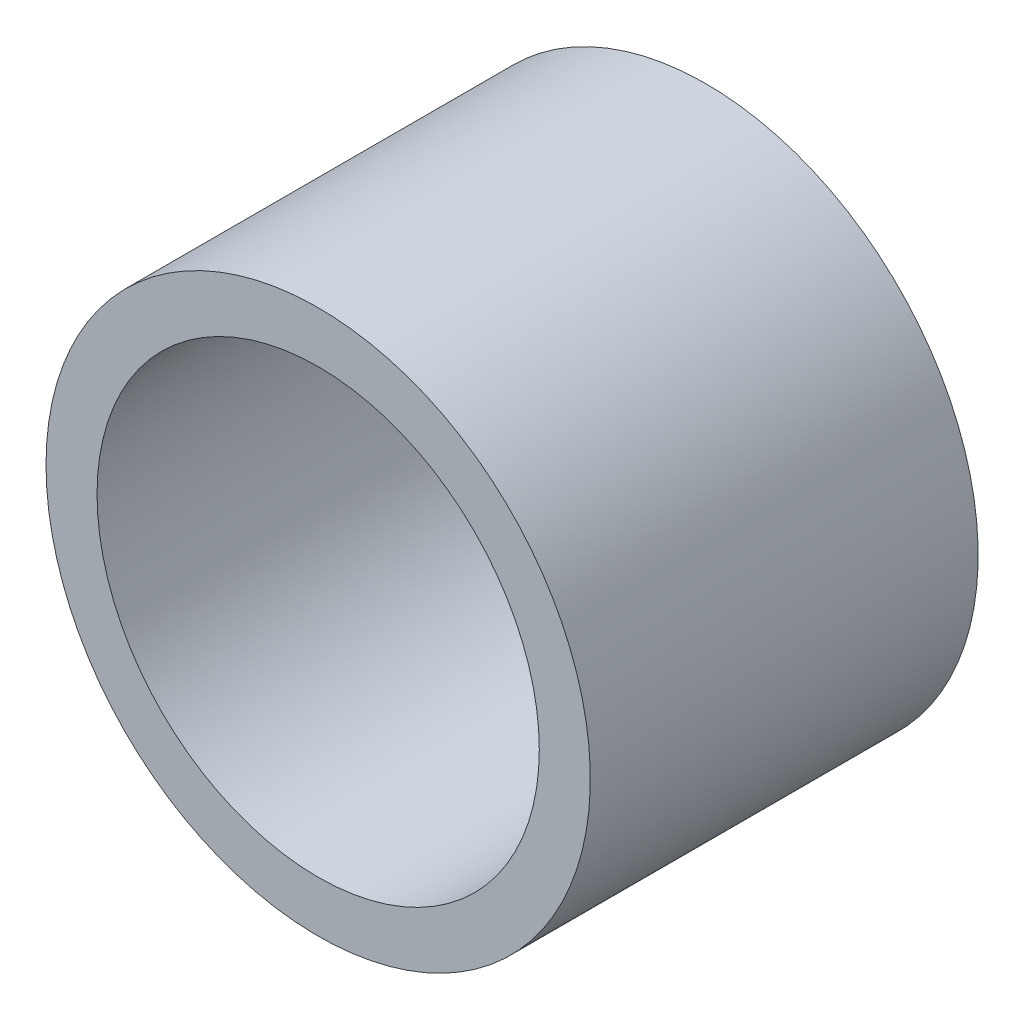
from build123d import *

# Parameters (mm, degrees)
ESQUISSE1_R        = 20
ESQUISSE1_R_2      = 16.25
BOSS_EXTRU_1_DEPTH = 28.5


with BuildPart() as part:
    # Esquisse1 → Boss.-Extru.1 (new body)
    with BuildSketch(Plane.XY):
        with Locations(Location((0, 0, 0), (0, 0, 180))):
            Circle(ESQUISSE1_R)
        with Locations(Location((0, 0, 0), (0, 0, 180))):
            Circle(ESQUISSE1_R_2, mode=Mode.SUBTRACT)
    extrude(amount=BOSS_EXTRU_1_DEPTH)


solid = part.part
